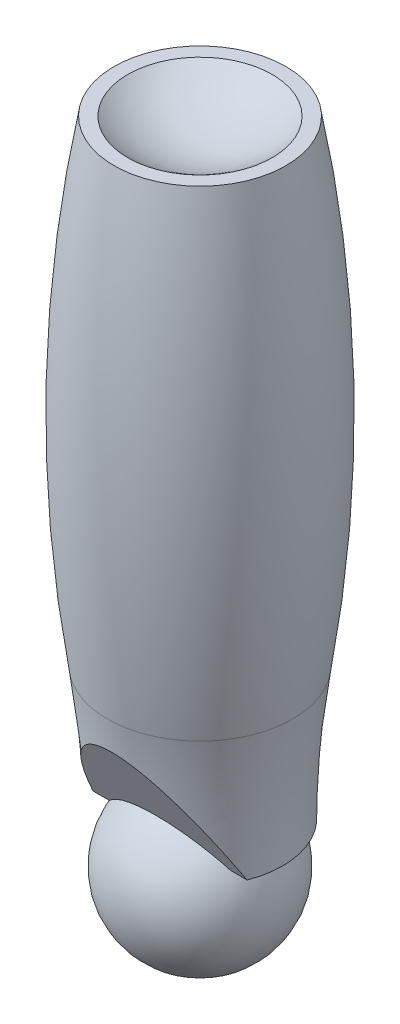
ISO-10303-21;
HEADER;
FILE_DESCRIPTION(('STEP AP214'),'2;1');
FILE_NAME('part.step','',(''),(''),'','','');
FILE_SCHEMA(('AUTOMOTIVE_DESIGN { 1 0 10303 214 1 1 1 1 }'));
ENDSEC;
DATA;
#1=APPLICATION_CONTEXT('core data for automotive mechanical design processes');
#2=APPLICATION_PROTOCOL_DEFINITION('international standard','automotive_design',2000,#1);
#3=PRODUCT_CONTEXT('',#1,'mechanical');
#4=PRODUCT('Part','Part','',(#3));
#5=PRODUCT_RELATED_PRODUCT_CATEGORY('part','',(#4));
#6=PRODUCT_DEFINITION_FORMATION('','',#4);
#7=PRODUCT_DEFINITION_CONTEXT('part definition',#1,'design');
#8=PRODUCT_DEFINITION('design','',#6,#7);
#9=PRODUCT_DEFINITION_SHAPE('','',#8);
#10=(LENGTH_UNIT() NAMED_UNIT(*) SI_UNIT(.MILLI.,.METRE.));
#11=(NAMED_UNIT(*) PLANE_ANGLE_UNIT() SI_UNIT($,.RADIAN.));
#12=(NAMED_UNIT(*) SI_UNIT($,.STERADIAN.) SOLID_ANGLE_UNIT());
#13=UNCERTAINTY_MEASURE_WITH_UNIT(LENGTH_MEASURE(1.E-05),#10,'distance_accuracy_value','');
#14=(GEOMETRIC_REPRESENTATION_CONTEXT(3) GLOBAL_UNCERTAINTY_ASSIGNED_CONTEXT((#13)) GLOBAL_UNIT_ASSIGNED_CONTEXT((#10,
#11,#12)) REPRESENTATION_CONTEXT('',''));
#15=CARTESIAN_POINT('',(0.,0.,0.));
#16=DIRECTION('',(0.,0.,1.));
#17=DIRECTION('',(1.,0.,0.));
#18=AXIS2_PLACEMENT_3D('',#15,#16,#17);
#19=CARTESIAN_POINT('',(35.9375,0.,0.));
#20=DIRECTION('',(0.,-1.,0.));
#21=DIRECTION('',(0.,0.,-1.));
#22=AXIS2_PLACEMENT_3D('',#19,#20,#21);
#23=PLANE('',#22);
#24=DIRECTION('',(1.,0.,0.));
#25=VECTOR('',#24,1.);
#26=CARTESIAN_POINT('',(35.9375,0.,13.));
#27=LINE('',#26,#25);
#28=CARTESIAN_POINT('',(26.4054918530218,0.,13.));
#29=VERTEX_POINT('',#28);
#30=CARTESIAN_POINT('',(33.5037894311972,0.,13.));
#31=VERTEX_POINT('',#30);
#32=EDGE_CURVE('E52',#29,#31,#27,.T.);
#33=ORIENTED_EDGE('',*,*,#32,.F.);
#34=CARTESIAN_POINT('',(0.,0.,0.));
#35=DIRECTION('',(0.,-1.,0.));
#36=DIRECTION('',(0.,0.,-1.));
#37=AXIS2_PLACEMENT_3D('',#34,#35,#36);
#38=CIRCLE('',#37,29.4321253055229);
#39=CARTESIAN_POINT('',(-26.4054918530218,0.,13.));
#40=VERTEX_POINT('',#39);
#41=EDGE_CURVE('E67',#29,#40,#38,.F.);
#42=ORIENTED_EDGE('',*,*,#41,.T.);
#43=CARTESIAN_POINT('',(-33.5037894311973,0.,13.));
#44=VERTEX_POINT('',#43);
#45=EDGE_CURVE('E59',#44,#40,#27,.T.);
#46=ORIENTED_EDGE('',*,*,#45,.F.);
#47=CARTESIAN_POINT('',(0.,0.,0.));
#48=DIRECTION('',(0.,-1.,0.));
#49=DIRECTION('',(0.,0.,-1.));
#50=AXIS2_PLACEMENT_3D('',#47,#48,#49);
#51=CIRCLE('',#50,35.9375000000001);
#52=EDGE_CURVE('E114',#44,#31,#51,.T.);
#53=ORIENTED_EDGE('',*,*,#52,.T.);
#54=EDGE_LOOP('',(#33,#42,#46,#53));
#55=FACE_BOUND('',#54,.T.);
#56=ADVANCED_FACE('F36',(#55),#23,.T.);
#57=CARTESIAN_POINT('',(0.,-5.62916512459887,9.74999999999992));
#58=DIRECTION('',(0.,0.500000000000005,-0.866025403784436));
#59=DIRECTION('',(0.,0.866025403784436,0.500000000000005));
#60=AXIS2_PLACEMENT_3D('',#57,#58,#59);
#61=PLANE('',#60);
#62=CARTESIAN_POINT('',(0.,-19.1291651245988,1.95577136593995));
#63=DIRECTION('',(0.,0.500000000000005,-0.866025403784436));
#64=DIRECTION('',(0.,0.866025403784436,0.500000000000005));
#65=AXIS2_PLACEMENT_3D('',#62,#63,#64);
#66=CIRCLE('',#65,34.4260068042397);
#67=EDGE_CURVE('E12',#29,#40,#66,.F.);
#68=ORIENTED_EDGE('',*,*,#67,.F.);
#69=ORIENTED_EDGE('',*,*,#32,.T.);
#70=CARTESIAN_POINT('',(33.5038342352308,-0.000199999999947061,12.9998845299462));
#71=CARTESIAN_POINT('',(33.3630988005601,0.628010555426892,13.3625820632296));
#72=CARTESIAN_POINT('',(33.2174410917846,1.25538797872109,13.7247985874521));
#73=CARTESIAN_POINT('',(32.9159746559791,2.50832330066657,14.4481811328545));
#74=CARTESIAN_POINT('',(32.760165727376,3.13388116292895,14.8093471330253));
#75=CARTESIAN_POINT('',(32.2769890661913,5.00783733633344,15.89127623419));
#76=CARTESIAN_POINT('',(31.9339341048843,6.2532372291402,16.6103081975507));
#77=CARTESIAN_POINT('',(31.2006217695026,8.74286798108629,18.0476971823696));
#78=CARTESIAN_POINT('',(30.8100511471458,9.98702978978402,18.7660143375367));
#79=CARTESIAN_POINT('',(29.9801182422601,12.4630111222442,20.1955228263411));
#80=CARTESIAN_POINT('',(29.5407598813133,13.6948316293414,20.906714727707));
#81=CARTESIAN_POINT('',(28.587161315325,16.200422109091,22.3533180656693));
#82=CARTESIAN_POINT('',(28.0703873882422,17.4734755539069,23.0883158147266));
#83=CARTESIAN_POINT('',(27.2468236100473,19.3673647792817,24.1817532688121));
#84=CARTESIAN_POINT('',(26.9641949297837,19.996127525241,24.5447696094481));
#85=CARTESIAN_POINT('',(26.381852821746,21.2476811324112,25.2673544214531));
#86=CARTESIAN_POINT('',(26.0821400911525,21.870472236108,25.6269230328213));
#87=CARTESIAN_POINT('',(25.4654419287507,23.1075375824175,26.3411430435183));
#88=CARTESIAN_POINT('',(25.1485074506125,23.7218308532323,26.6958054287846));
#89=CARTESIAN_POINT('',(24.495425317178,24.9426825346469,27.4006644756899));
#90=CARTESIAN_POINT('',(24.159278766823,25.549241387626,27.7508613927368));
#91=CARTESIAN_POINT('',(23.4665283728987,26.7532837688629,28.4460155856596));
#92=CARTESIAN_POINT('',(23.1099317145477,27.3507703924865,28.7909746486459));
#93=CARTESIAN_POINT('',(22.3746690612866,28.5354300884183,29.4749382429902));
#94=CARTESIAN_POINT('',(21.9960053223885,29.1226042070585,29.8139433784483));
#95=CARTESIAN_POINT('',(21.331235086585,30.1117474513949,30.3850254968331));
#96=CARTESIAN_POINT('',(21.0511712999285,30.5167668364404,30.6188635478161));
#97=CARTESIAN_POINT('',(20.4786201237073,31.3201584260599,31.0827018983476));
#98=CARTESIAN_POINT('',(20.1861332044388,31.7185308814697,31.3127023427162));
#99=CARTESIAN_POINT('',(19.5878769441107,32.5079558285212,31.7684770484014));
#100=CARTESIAN_POINT('',(19.2821025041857,32.8990054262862,31.9942496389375));
#101=CARTESIAN_POINT('',(18.6565715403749,33.672643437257,32.4409097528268));
#102=CARTESIAN_POINT('',(18.3368149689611,34.0552318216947,32.6617972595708));
#103=CARTESIAN_POINT('',(17.6847862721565,34.8080890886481,33.0964596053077));
#104=CARTESIAN_POINT('',(17.352619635,35.1784263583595,33.3102739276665));
#105=CARTESIAN_POINT('',(16.6727577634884,35.9082451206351,33.731634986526));
#106=CARTESIAN_POINT('',(16.325063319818,36.2677271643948,33.9391820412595));
#107=CARTESIAN_POINT('',(15.6133637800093,36.9740659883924,34.3469869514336));
#108=CARTESIAN_POINT('',(15.24936751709,37.3209294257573,34.5472486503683));
#109=CARTESIAN_POINT('',(14.5039647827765,38.0002819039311,34.9394729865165));
#110=CARTESIAN_POINT('',(14.1225604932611,38.3327727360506,35.1314366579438));
#111=CARTESIAN_POINT('',(13.29953079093,39.0158617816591,35.5258183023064));
#112=CARTESIAN_POINT('',(12.8558277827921,39.3645923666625,35.7271579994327));
#113=CARTESIAN_POINT('',(11.9446708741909,40.0380440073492,36.1159754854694));
#114=CARTESIAN_POINT('',(11.4772175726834,40.3627656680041,36.3034536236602));
#115=CARTESIAN_POINT('',(10.5178530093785,40.9836785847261,36.661937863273));
#116=CARTESIAN_POINT('',(10.0259512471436,41.2798807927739,36.8329502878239));
#117=CARTESIAN_POINT('',(9.01711367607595,41.8387618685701,37.1556204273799));
#118=CARTESIAN_POINT('',(8.50017561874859,42.1014377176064,37.3072763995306));
#119=CARTESIAN_POINT('',(7.54025092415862,42.5422171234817,37.561760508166));
#120=CARTESIAN_POINT('',(7.10133853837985,42.7269696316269,37.668427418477));
#121=CARTESIAN_POINT('',(6.208644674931,43.0668192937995,37.8646397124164));
#122=CARTESIAN_POINT('',(5.75487132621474,43.2219323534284,37.954194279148));
#123=CARTESIAN_POINT('',(4.83435797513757,43.4991291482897,38.1142339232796));
#124=CARTESIAN_POINT('',(4.36762761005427,43.6212367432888,38.1847327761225));
#125=CARTESIAN_POINT('',(3.42352088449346,43.8294786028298,38.304961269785));
#126=CARTESIAN_POINT('',(2.94614465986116,43.9156133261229,38.3546911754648));
#127=CARTESIAN_POINT('',(1.98055349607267,44.0499639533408,38.4322585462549));
#128=CARTESIAN_POINT('',(1.49228377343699,44.0978868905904,38.4599268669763));
#129=CARTESIAN_POINT('',(0.512671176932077,44.153217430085,38.491871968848));
#130=CARTESIAN_POINT('',(0.0213283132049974,44.16062516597,38.4961488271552));
#131=CARTESIAN_POINT('',(-0.959974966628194,44.1346862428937,38.4811729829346));
#132=CARTESIAN_POINT('',(-1.44993518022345,44.1013338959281,38.4619169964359));
#133=CARTESIAN_POINT('',(-2.42402949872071,43.9949230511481,38.4004806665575));
#134=CARTESIAN_POINT('',(-2.90816376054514,43.9218656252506,38.3583009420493));
#135=CARTESIAN_POINT('',(-3.81430197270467,43.7482976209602,38.2580914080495));
#136=CARTESIAN_POINT('',(-4.23730913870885,43.6516643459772,38.2023001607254));
#137=CARTESIAN_POINT('',(-5.07368442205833,43.4306954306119,38.0747236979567));
#138=CARTESIAN_POINT('',(-5.48704915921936,43.3063502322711,38.0029329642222));
#139=CARTESIAN_POINT('',(-6.30230863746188,43.0323631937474,37.8447464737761));
#140=CARTESIAN_POINT('',(-6.70420540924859,42.8827258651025,37.7583533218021));
#141=CARTESIAN_POINT('',(-7.49562641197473,42.5605772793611,37.5723607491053));
#142=CARTESIAN_POINT('',(-7.88514734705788,42.388059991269,37.4727578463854));
#143=CARTESIAN_POINT('',(-8.89978031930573,41.903944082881,37.1932533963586));
#144=CARTESIAN_POINT('',(-9.51375321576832,41.574737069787,37.0031856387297));
#145=CARTESIAN_POINT('',(-10.705717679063,40.8706060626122,36.5966554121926));
#146=CARTESIAN_POINT('',(-11.2836879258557,40.4956553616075,36.3801775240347));
#147=CARTESIAN_POINT('',(-12.4057861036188,39.7076514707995,35.9252232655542));
#148=CARTESIAN_POINT('',(-12.9498366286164,39.2945161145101,35.6866994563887));
#149=CARTESIAN_POINT('',(-14.0048628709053,38.4375328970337,35.1919199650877));
#150=CARTESIAN_POINT('',(-14.5158253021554,37.9936728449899,34.9356572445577));
#151=CARTESIAN_POINT('',(-15.462445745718,37.1216471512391,34.4321929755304));
#152=CARTESIAN_POINT('',(-15.9007524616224,36.6956247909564,34.1862288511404));
#153=CARTESIAN_POINT('',(-16.7533576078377,35.8261054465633,33.6842116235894));
#154=CARTESIAN_POINT('',(-17.1676601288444,35.3826114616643,33.428160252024));
#155=CARTESIAN_POINT('',(-17.9743621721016,34.4803708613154,32.9072513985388));
#156=CARTESIAN_POINT('',(-18.3667427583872,34.0216115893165,32.642386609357));
#157=CARTESIAN_POINT('',(-19.13080893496,33.091348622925,32.1052990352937));
#158=CARTESIAN_POINT('',(-19.502493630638,32.6198443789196,31.8330759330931));
#159=CARTESIAN_POINT('',(-20.2286817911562,31.6631219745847,31.2807119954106));
#160=CARTESIAN_POINT('',(-20.5830732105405,31.1778401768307,31.0005344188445));
#161=CARTESIAN_POINT('',(-21.273661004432,30.1976982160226,30.4346491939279));
#162=CARTESIAN_POINT('',(-21.6098577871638,29.7028382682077,30.1489416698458));
#163=CARTESIAN_POINT('',(-22.2651162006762,28.7049641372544,29.5728187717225));
#164=CARTESIAN_POINT('',(-22.5841848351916,28.2019533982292,29.282405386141));
#165=CARTESIAN_POINT('',(-23.2063976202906,27.1885860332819,28.6973374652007));
#166=CARTESIAN_POINT('',(-23.5095408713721,26.6782289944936,28.4026826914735));
#167=CARTESIAN_POINT('',(-24.4062007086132,25.120667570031,27.5034241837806));
#168=CARTESIAN_POINT('',(-24.9763145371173,24.0633076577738,26.8929571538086));
#169=CARTESIAN_POINT('',(-26.0615114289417,21.9275602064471,25.659882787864));
#170=CARTESIAN_POINT('',(-26.5765839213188,20.8491686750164,25.0372731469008));
#171=CARTESIAN_POINT('',(-27.557706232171,18.6740622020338,23.7814748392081));
#172=CARTESIAN_POINT('',(-28.0236848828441,17.5773232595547,23.148272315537));
#173=CARTESIAN_POINT('',(-28.9101345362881,15.3702823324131,21.8740366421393));
#174=CARTESIAN_POINT('',(-29.3306087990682,14.25998132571,21.2330040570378));
#175=CARTESIAN_POINT('',(-30.1170129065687,12.0635560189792,19.9648973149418));
#176=CARTESIAN_POINT('',(-30.4842494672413,10.9777813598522,19.3380250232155));
#177=CARTESIAN_POINT('',(-31.1821736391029,8.79743302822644,18.0792003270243));
#178=CARTESIAN_POINT('',(-31.5128596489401,7.70285897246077,17.44724770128));
#179=CARTESIAN_POINT('',(-32.1388243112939,5.51023737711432,16.1813370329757));
#180=CARTESIAN_POINT('',(-32.4342234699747,4.41221561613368,15.5473938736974));
#181=CARTESIAN_POINT('',(-32.8531532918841,2.76070580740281,14.5938942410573));
#182=CARTESIAN_POINT('',(-32.9887604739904,2.20949191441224,14.2756507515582));
#183=CARTESIAN_POINT('',(-33.252129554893,1.10566739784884,13.6383573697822));
#184=CARTESIAN_POINT('',(-33.3798915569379,0.553056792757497,13.3193074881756));
#185=CARTESIAN_POINT('',(-33.5038342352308,-0.000199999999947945,12.9998845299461));
#186=B_SPLINE_CURVE_WITH_KNOTS('',3,(#70,#71,#72,#73,#74,#75,#76,#77,#78,#79,#80,#81,#82,#83,
#84,#85,#86,#87,#88,#89,#90,#91,#92,#93,#94,#95,#96,#97,#98,#99,#100,#101,#102,#103,#104,#105,
#106,#107,#108,#109,#110,#111,#112,#113,#114,#115,#116,#117,#118,#119,#120,#121,#122,#123,#124,
#125,#126,#127,#128,#129,#130,#131,#132,#133,#134,#135,#136,#137,#138,#139,#140,#141,#142,#143,
#144,#145,#146,#147,#148,#149,#150,#151,#152,#153,#154,#155,#156,#157,#158,#159,#160,#161,#162,
#163,#164,#165,#166,#167,#168,#169,#170,#171,#172,#173,#174,#175,#176,#177,#178,#179,#180,#181,
#182,#183,#184,#185),.UNSPECIFIED.,.F.,.F.,(4,2,2,2,2,2,2,2,2,2,2,2,2,2,2,2,2,2,2,2,2,2,2,2,2,2,
2,2,2,2,2,2,2,2,2,2,2,2,2,2,2,2,2,2,2,2,2,2,2,2,2,2,2,2,2,2,2,4),(0.,2.21672991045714,
4.4335038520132,8.86804277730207,13.3335859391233,17.7987704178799,22.4718117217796,
24.8089459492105,27.1459848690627,29.4764504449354,31.8067821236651,34.1362999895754,
36.4655801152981,38.1007712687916,39.7359005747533,41.3716629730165,43.0074309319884,
44.631536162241,46.2555587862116,47.8787118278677,49.5016619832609,51.298219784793,
53.0947323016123,54.8905521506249,56.6865335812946,58.1492953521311,59.6112699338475,
61.0721848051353,62.5330810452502,64.0050729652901,65.4770600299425,66.9492525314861,
68.4214052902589,69.7325197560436,71.0440871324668,72.3554208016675,73.6671008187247,
75.8299210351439,77.9940100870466,80.1628693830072,82.3325942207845,84.308384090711,
86.2838362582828,88.260969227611,90.2381875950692,92.226863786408,94.2154953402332,
96.2033074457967,98.19123170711,102.231957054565,106.273457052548,110.320737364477,
114.367727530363,118.286400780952,122.205245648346,126.11029978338,128.062575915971,
130.014826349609),.UNSPECIFIED.);
#187=EDGE_CURVE('E43',#31,#44,#186,.T.);
#188=ORIENTED_EDGE('',*,*,#187,.T.);
#189=ORIENTED_EDGE('',*,*,#45,.T.);
#190=EDGE_LOOP('',(#68,#69,#188,#189));
#191=FACE_BOUND('',#190,.T.);
#192=ADVANCED_FACE('F61',(#191),#61,.F.);
#193=CARTESIAN_POINT('',(0.,264.5,0.));
#194=DIRECTION('',(0.,1.,0.));
#195=DIRECTION('',(0.,0.,1.));
#196=AXIS2_PLACEMENT_3D('',#193,#194,#195);
#197=PLANE('',#196);
#198=CARTESIAN_POINT('',(0.,264.5,0.));
#199=DIRECTION('',(0.,-1.,0.));
#200=DIRECTION('',(0.,0.,-1.));
#201=AXIS2_PLACEMENT_3D('',#198,#199,#200);
#202=CIRCLE('',#201,37.375);
#203=CARTESIAN_POINT('',(0.,264.5,-37.375));
#204=VERTEX_POINT('',#203);
#205=EDGE_CURVE('E97',#204,#204,#202,.T.);
#206=ORIENTED_EDGE('',*,*,#205,.F.);
#207=EDGE_LOOP('',(#206));
#208=FACE_BOUND('',#207,.T.);
#209=CARTESIAN_POINT('',(0.,264.5,0.));
#210=DIRECTION('',(0.,1.,0.));
#211=DIRECTION('',(0.,0.,1.));
#212=AXIS2_PLACEMENT_3D('',#209,#210,#211);
#213=CIRCLE('',#212,31.3995222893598);
#214=CARTESIAN_POINT('',(0.,264.5,31.3995222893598));
#215=VERTEX_POINT('',#214);
#216=EDGE_CURVE('E64',#215,#215,#213,.F.);
#217=ORIENTED_EDGE('',*,*,#216,.T.);
#218=EDGE_LOOP('',(#217));
#219=FACE_BOUND('',#218,.T.);
#220=ADVANCED_FACE('F85',(#208,#219),#197,.T.);
#221=CARTESIAN_POINT('',(0.,152.265477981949,0.));
#222=DIRECTION('',(0.,-1.,0.));
#223=DIRECTION('',(0.,0.,-1.));
#224=AXIS2_PLACEMENT_3D('',#221,#222,#223);
#225=DEGENERATE_TOROIDAL_SURFACE('',#224,583.511162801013,630.948662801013,.F.);
#226=ORIENTED_EDGE('',*,*,#205,.T.);
#227=EDGE_LOOP('',(#226));
#228=FACE_BOUND('',#227,.T.);
#229=CARTESIAN_POINT('',(0.,57.5000000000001,0.));
#230=DIRECTION('',(0.,-1.,0.));
#231=DIRECTION('',(0.,0.,-1.));
#232=AXIS2_PLACEMENT_3D('',#229,#230,#231);
#233=CIRCLE('',#232,40.2802440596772);
#234=CARTESIAN_POINT('',(0.,57.5000000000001,-40.2802440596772));
#235=VERTEX_POINT('',#234);
#236=EDGE_CURVE('E112',#235,#235,#233,.T.);
#237=ORIENTED_EDGE('',*,*,#236,.F.);
#238=EDGE_LOOP('',(#237));
#239=FACE_BOUND('',#238,.T.);
#240=ADVANCED_FACE('F89',(#228,#239),#225,.F.);
#241=CARTESIAN_POINT('',(0.,0.,0.));
#242=DIRECTION('',(0.,-1.,0.));
#243=DIRECTION('',(0.,0.,-1.));
#244=AXIS2_PLACEMENT_3D('',#241,#242,#243);
#245=TOROIDAL_SURFACE('',#244,418.772566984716,382.835066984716);
#246=ORIENTED_EDGE('',*,*,#187,.F.);
#247=ORIENTED_EDGE('',*,*,#52,.F.);
#248=EDGE_LOOP('',(#246,#247));
#249=FACE_BOUND('',#248,.T.);
#250=ORIENTED_EDGE('',*,*,#236,.T.);
#251=EDGE_LOOP('',(#250));
#252=FACE_BOUND('',#251,.T.);
#253=ADVANCED_FACE('F77',(#249,#252),#245,.F.);
#254=CARTESIAN_POINT('',(0.,303.815,0.));
#255=DIRECTION('',(0.,-1.,0.));
#256=DIRECTION('',(-1.,0.,0.));
#257=AXIS2_PLACEMENT_3D('',#254,#255,#256);
#258=SPHERICAL_SURFACE('',#257,50.315);
#259=ORIENTED_EDGE('',*,*,#216,.F.);
#260=EDGE_LOOP('',(#259));
#261=FACE_BOUND('',#260,.T.);
#262=ADVANCED_FACE('F72',(#261),#258,.F.);
#263=CARTESIAN_POINT('',(0.,-18.,0.));
#264=DIRECTION('',(0.,-1.,0.));
#265=DIRECTION('',(-1.,0.,0.));
#266=AXIS2_PLACEMENT_3D('',#263,#264,#265);
#267=SPHERICAL_SURFACE('',#266,34.5);
#268=ORIENTED_EDGE('',*,*,#41,.F.);
#269=ORIENTED_EDGE('',*,*,#67,.T.);
#270=EDGE_LOOP('',(#268,#269));
#271=FACE_BOUND('',#270,.T.);
#272=ADVANCED_FACE('F70',(#271),#267,.T.);
#273=CLOSED_SHELL('',(#56,#192,#220,#240,#253,#262,#272));
#274=MANIFOLD_SOLID_BREP('B2',#273);
#275=ADVANCED_BREP_SHAPE_REPRESENTATION('',(#18,#274),#14);
#276=SHAPE_DEFINITION_REPRESENTATION(#9,#275);
ENDSEC;
END-ISO-10303-21;
